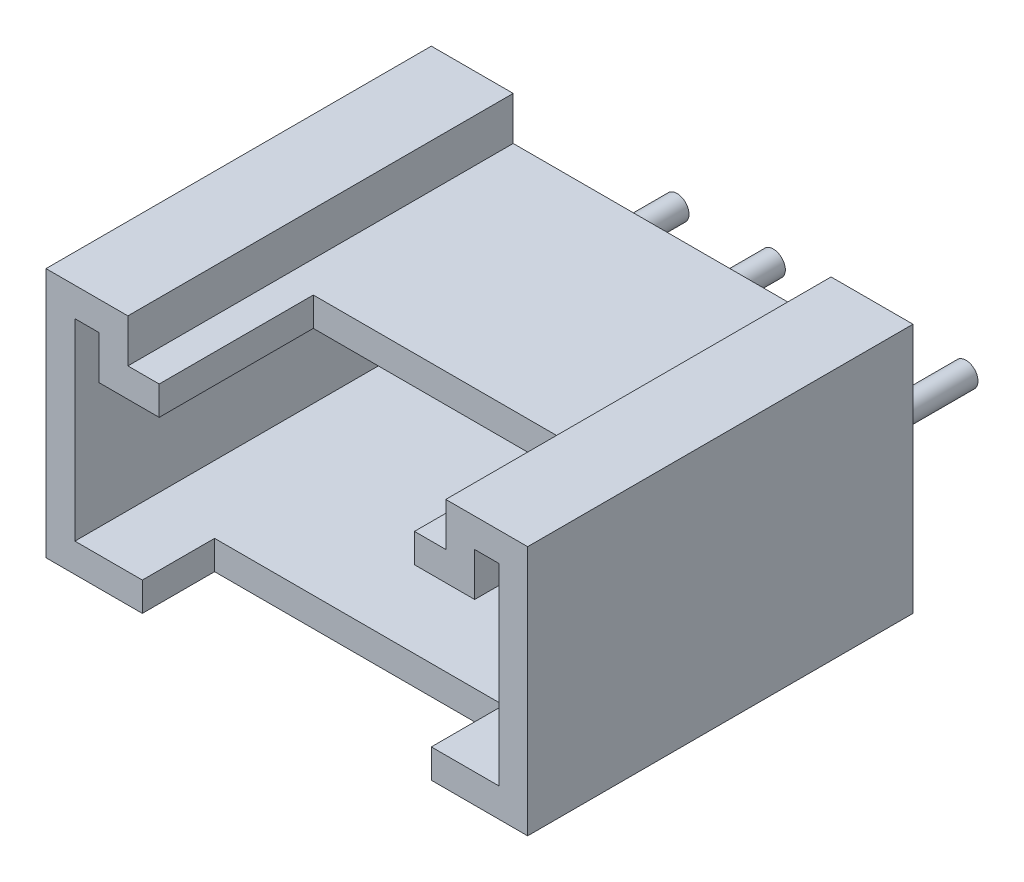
ISO-10303-21;
HEADER;
FILE_DESCRIPTION(('STEP AP214'),'2;1');
FILE_NAME('part.step','',(''),(''),'','','');
FILE_SCHEMA(('AUTOMOTIVE_DESIGN { 1 0 10303 214 1 1 1 1 }'));
ENDSEC;
DATA;
#1=APPLICATION_CONTEXT('core data for automotive mechanical design processes');
#2=APPLICATION_PROTOCOL_DEFINITION('international standard','automotive_design',2000,#1);
#3=PRODUCT_CONTEXT('',#1,'mechanical');
#4=PRODUCT('Part','Part','',(#3));
#5=PRODUCT_RELATED_PRODUCT_CATEGORY('part','',(#4));
#6=PRODUCT_DEFINITION_FORMATION('','',#4);
#7=PRODUCT_DEFINITION_CONTEXT('part definition',#1,'design');
#8=PRODUCT_DEFINITION('design','',#6,#7);
#9=PRODUCT_DEFINITION_SHAPE('','',#8);
#10=(LENGTH_UNIT() NAMED_UNIT(*) SI_UNIT(.MILLI.,.METRE.));
#11=(NAMED_UNIT(*) PLANE_ANGLE_UNIT() SI_UNIT($,.RADIAN.));
#12=(NAMED_UNIT(*) SI_UNIT($,.STERADIAN.) SOLID_ANGLE_UNIT());
#13=UNCERTAINTY_MEASURE_WITH_UNIT(LENGTH_MEASURE(1.E-05),#10,'distance_accuracy_value','');
#14=(GEOMETRIC_REPRESENTATION_CONTEXT(3) GLOBAL_UNCERTAINTY_ASSIGNED_CONTEXT((#13)) GLOBAL_UNIT_ASSIGNED_CONTEXT((#10,
#11,#12)) REPRESENTATION_CONTEXT('',''));
#15=CARTESIAN_POINT('',(0.,0.,0.));
#16=DIRECTION('',(0.,0.,1.));
#17=DIRECTION('',(1.,0.,0.));
#18=AXIS2_PLACEMENT_3D('',#15,#16,#17);
#19=CARTESIAN_POINT('',(0.,0.,8.));
#20=DIRECTION('',(0.,0.,1.));
#21=DIRECTION('',(1.,0.,0.));
#22=AXIS2_PLACEMENT_3D('',#19,#20,#21);
#23=PLANE('',#22);
#24=DIRECTION('',(0.,1.,0.));
#25=VECTOR('',#24,1.);
#26=CARTESIAN_POINT('',(-2.65,3.7,8.));
#27=LINE('',#26,#25);
#28=CARTESIAN_POINT('',(-2.65,3.7,8.));
#29=VERTEX_POINT('',#28);
#30=CARTESIAN_POINT('',(-2.65,4.3,8.));
#31=VERTEX_POINT('',#30);
#32=EDGE_CURVE('E198',#29,#31,#27,.T.);
#33=ORIENTED_EDGE('',*,*,#32,.T.);
#34=DIRECTION('',(-1.,0.,0.));
#35=VECTOR('',#34,1.);
#36=CARTESIAN_POINT('',(-3.3,4.3,8.));
#37=LINE('',#36,#35);
#38=CARTESIAN_POINT('',(-3.3,4.3,8.));
#39=VERTEX_POINT('',#38);
#40=EDGE_CURVE('E250',#31,#39,#37,.T.);
#41=ORIENTED_EDGE('',*,*,#40,.T.);
#42=DIRECTION('',(0.,1.,0.));
#43=VECTOR('',#42,1.);
#44=CARTESIAN_POINT('',(-3.3,4.3,8.));
#45=LINE('',#44,#43);
#46=CARTESIAN_POINT('',(-3.3,5.2,8.));
#47=VERTEX_POINT('',#46);
#48=EDGE_CURVE('E249',#39,#47,#45,.T.);
#49=ORIENTED_EDGE('',*,*,#48,.T.);
#50=DIRECTION('',(-1.,0.,0.));
#51=VECTOR('',#50,1.);
#52=CARTESIAN_POINT('',(-3.3,5.2,8.));
#53=LINE('',#52,#51);
#54=CARTESIAN_POINT('',(-5.,5.2,8.));
#55=VERTEX_POINT('',#54);
#56=EDGE_CURVE('E252',#47,#55,#53,.T.);
#57=ORIENTED_EDGE('',*,*,#56,.T.);
#58=DIRECTION('',(0.,-1.,0.));
#59=VECTOR('',#58,1.);
#60=CARTESIAN_POINT('',(-5.,5.2,8.));
#61=LINE('',#60,#59);
#62=CARTESIAN_POINT('',(-5.,0.,8.));
#63=VERTEX_POINT('',#62);
#64=EDGE_CURVE('E254',#55,#63,#61,.T.);
#65=ORIENTED_EDGE('',*,*,#64,.T.);
#66=DIRECTION('',(1.,0.,0.));
#67=VECTOR('',#66,1.);
#68=CARTESIAN_POINT('',(-5.,0.,8.));
#69=LINE('',#68,#67);
#70=CARTESIAN_POINT('',(-3.,0.,8.));
#71=VERTEX_POINT('',#70);
#72=EDGE_CURVE('E257',#63,#71,#69,.T.);
#73=ORIENTED_EDGE('',*,*,#72,.T.);
#74=DIRECTION('',(0.,-1.,0.));
#75=VECTOR('',#74,1.);
#76=CARTESIAN_POINT('',(-3.,0.6,8.));
#77=LINE('',#76,#75);
#78=CARTESIAN_POINT('',(-3.,0.6,8.));
#79=VERTEX_POINT('',#78);
#80=EDGE_CURVE('E402',#79,#71,#77,.T.);
#81=ORIENTED_EDGE('',*,*,#80,.F.);
#82=DIRECTION('',(1.,0.,0.));
#83=VECTOR('',#82,1.);
#84=CARTESIAN_POINT('',(-5.,0.6,8.));
#85=LINE('',#84,#83);
#86=CARTESIAN_POINT('',(-4.4,0.6,8.));
#87=VERTEX_POINT('',#86);
#88=EDGE_CURVE('E235',#87,#79,#85,.T.);
#89=ORIENTED_EDGE('',*,*,#88,.F.);
#90=DIRECTION('',(0.,-1.,0.));
#91=VECTOR('',#90,1.);
#92=CARTESIAN_POINT('',(-4.4,5.2,8.));
#93=LINE('',#92,#91);
#94=CARTESIAN_POINT('',(-4.4,4.6,8.));
#95=VERTEX_POINT('',#94);
#96=EDGE_CURVE('E232',#95,#87,#93,.T.);
#97=ORIENTED_EDGE('',*,*,#96,.F.);
#98=DIRECTION('',(-1.,0.,0.));
#99=VECTOR('',#98,1.);
#100=CARTESIAN_POINT('',(-3.3,4.6,8.));
#101=LINE('',#100,#99);
#102=CARTESIAN_POINT('',(-3.9,4.6,8.));
#103=VERTEX_POINT('',#102);
#104=EDGE_CURVE('E230',#103,#95,#101,.T.);
#105=ORIENTED_EDGE('',*,*,#104,.F.);
#106=DIRECTION('',(0.,1.,0.));
#107=VECTOR('',#106,1.);
#108=CARTESIAN_POINT('',(-3.9,4.3,8.));
#109=LINE('',#108,#107);
#110=CARTESIAN_POINT('',(-3.9,3.7,8.));
#111=VERTEX_POINT('',#110);
#112=EDGE_CURVE('E220',#111,#103,#109,.T.);
#113=ORIENTED_EDGE('',*,*,#112,.F.);
#114=DIRECTION('',(-1.,0.,0.));
#115=VECTOR('',#114,1.);
#116=CARTESIAN_POINT('',(-3.3,3.7,8.));
#117=LINE('',#116,#115);
#118=EDGE_CURVE('E212',#29,#111,#117,.T.);
#119=ORIENTED_EDGE('',*,*,#118,.F.);
#120=EDGE_LOOP('',(#33,#41,#49,#57,#65,#73,#81,#89,#97,#105,#113,#119));
#121=FACE_BOUND('',#120,.T.);
#122=ADVANCED_FACE('F37',(#121),#23,.T.);
#123=CARTESIAN_POINT('',(-3.3,4.3,8.));
#124=DIRECTION('',(0.,-1.,0.));
#125=DIRECTION('',(0.,0.,-1.));
#126=AXIS2_PLACEMENT_3D('',#123,#124,#125);
#127=PLANE('',#126);
#128=ORIENTED_EDGE('',*,*,#40,.F.);
#129=DIRECTION('',(0.,0.,1.));
#130=VECTOR('',#129,1.);
#131=CARTESIAN_POINT('',(-2.65,4.3,8.));
#132=LINE('',#131,#130);
#133=CARTESIAN_POINT('',(-2.65,4.3,4.8));
#134=VERTEX_POINT('',#133);
#135=EDGE_CURVE('E203',#134,#31,#132,.T.);
#136=ORIENTED_EDGE('',*,*,#135,.F.);
#137=DIRECTION('',(-1.,0.,0.));
#138=VECTOR('',#137,1.);
#139=CARTESIAN_POINT('',(-2.65,4.3,4.8));
#140=LINE('',#139,#138);
#141=CARTESIAN_POINT('',(2.65,4.3,4.8));
#142=VERTEX_POINT('',#141);
#143=EDGE_CURVE('E216',#142,#134,#140,.T.);
#144=ORIENTED_EDGE('',*,*,#143,.F.);
#145=DIRECTION('',(0.,0.,-1.));
#146=VECTOR('',#145,1.);
#147=CARTESIAN_POINT('',(2.65,4.3,8.));
#148=LINE('',#147,#146);
#149=CARTESIAN_POINT('',(2.65,4.3,8.));
#150=VERTEX_POINT('',#149);
#151=EDGE_CURVE('E373',#150,#142,#148,.T.);
#152=ORIENTED_EDGE('',*,*,#151,.F.);
#153=CARTESIAN_POINT('',(3.3,4.3,8.));
#154=VERTEX_POINT('',#153);
#155=EDGE_CURVE('E246',#154,#150,#37,.T.);
#156=ORIENTED_EDGE('',*,*,#155,.F.);
#157=DIRECTION('',(0.,0.,-1.));
#158=VECTOR('',#157,1.);
#159=CARTESIAN_POINT('',(3.3,4.3,8.));
#160=LINE('',#159,#158);
#161=CARTESIAN_POINT('',(3.3,4.3,0.));
#162=VERTEX_POINT('',#161);
#163=EDGE_CURVE('E266',#154,#162,#160,.T.);
#164=ORIENTED_EDGE('',*,*,#163,.T.);
#165=DIRECTION('',(-1.,0.,0.));
#166=VECTOR('',#165,1.);
#167=CARTESIAN_POINT('',(-3.3,4.3,0.));
#168=LINE('',#167,#166);
#169=CARTESIAN_POINT('',(-3.3,4.3,0.));
#170=VERTEX_POINT('',#169);
#171=EDGE_CURVE('E267',#162,#170,#168,.T.);
#172=ORIENTED_EDGE('',*,*,#171,.T.);
#173=DIRECTION('',(0.,0.,-1.));
#174=VECTOR('',#173,1.);
#175=CARTESIAN_POINT('',(-3.3,4.3,8.));
#176=LINE('',#175,#174);
#177=EDGE_CURVE('E305',#39,#170,#176,.T.);
#178=ORIENTED_EDGE('',*,*,#177,.F.);
#179=EDGE_LOOP('',(#128,#136,#144,#152,#156,#164,#172,#178));
#180=FACE_BOUND('',#179,.T.);
#181=ADVANCED_FACE('F39',(#180),#127,.F.);
#182=CARTESIAN_POINT('',(-3.3,4.3,8.));
#183=DIRECTION('',(-1.,0.,0.));
#184=DIRECTION('',(0.,0.,1.));
#185=AXIS2_PLACEMENT_3D('',#182,#183,#184);
#186=PLANE('',#185);
#187=DIRECTION('',(0.,1.,0.));
#188=VECTOR('',#187,1.);
#189=CARTESIAN_POINT('',(-3.3,4.3,0.));
#190=LINE('',#189,#188);
#191=CARTESIAN_POINT('',(-3.3,5.2,0.));
#192=VERTEX_POINT('',#191);
#193=EDGE_CURVE('E270',#170,#192,#190,.T.);
#194=ORIENTED_EDGE('',*,*,#193,.T.);
#195=DIRECTION('',(0.,0.,-1.));
#196=VECTOR('',#195,1.);
#197=CARTESIAN_POINT('',(-3.3,5.2,8.));
#198=LINE('',#197,#196);
#199=EDGE_CURVE('E302',#47,#192,#198,.T.);
#200=ORIENTED_EDGE('',*,*,#199,.F.);
#201=ORIENTED_EDGE('',*,*,#48,.F.);
#202=ORIENTED_EDGE('',*,*,#177,.T.);
#203=EDGE_LOOP('',(#194,#200,#201,#202));
#204=FACE_BOUND('',#203,.T.);
#205=ADVANCED_FACE('F370',(#204),#186,.F.);
#206=CARTESIAN_POINT('',(-3.3,5.2,8.));
#207=DIRECTION('',(0.,-1.,0.));
#208=DIRECTION('',(0.,0.,-1.));
#209=AXIS2_PLACEMENT_3D('',#206,#207,#208);
#210=PLANE('',#209);
#211=DIRECTION('',(-1.,0.,0.));
#212=VECTOR('',#211,1.);
#213=CARTESIAN_POINT('',(-3.3,5.2,0.));
#214=LINE('',#213,#212);
#215=CARTESIAN_POINT('',(-5.,5.2,0.));
#216=VERTEX_POINT('',#215);
#217=EDGE_CURVE('E273',#192,#216,#214,.T.);
#218=ORIENTED_EDGE('',*,*,#217,.T.);
#219=DIRECTION('',(0.,0.,-1.));
#220=VECTOR('',#219,1.);
#221=CARTESIAN_POINT('',(-5.,5.2,8.));
#222=LINE('',#221,#220);
#223=EDGE_CURVE('E299',#55,#216,#222,.T.);
#224=ORIENTED_EDGE('',*,*,#223,.F.);
#225=ORIENTED_EDGE('',*,*,#56,.F.);
#226=ORIENTED_EDGE('',*,*,#199,.T.);
#227=EDGE_LOOP('',(#218,#224,#225,#226));
#228=FACE_BOUND('',#227,.T.);
#229=ADVANCED_FACE('F365',(#228),#210,.F.);
#230=CARTESIAN_POINT('',(-5.,5.2,8.));
#231=DIRECTION('',(1.,0.,0.));
#232=DIRECTION('',(0.,0.,-1.));
#233=AXIS2_PLACEMENT_3D('',#230,#231,#232);
#234=PLANE('',#233);
#235=DIRECTION('',(0.,-1.,0.));
#236=VECTOR('',#235,1.);
#237=CARTESIAN_POINT('',(-5.,5.2,0.));
#238=LINE('',#237,#236);
#239=CARTESIAN_POINT('',(-5.,0.,0.));
#240=VERTEX_POINT('',#239);
#241=EDGE_CURVE('E275',#216,#240,#238,.T.);
#242=ORIENTED_EDGE('',*,*,#241,.T.);
#243=DIRECTION('',(0.,0.,-1.));
#244=VECTOR('',#243,1.);
#245=CARTESIAN_POINT('',(-5.,0.,8.));
#246=LINE('',#245,#244);
#247=EDGE_CURVE('E296',#63,#240,#246,.T.);
#248=ORIENTED_EDGE('',*,*,#247,.F.);
#249=ORIENTED_EDGE('',*,*,#64,.F.);
#250=ORIENTED_EDGE('',*,*,#223,.T.);
#251=EDGE_LOOP('',(#242,#248,#249,#250));
#252=FACE_BOUND('',#251,.T.);
#253=ADVANCED_FACE('F362',(#252),#234,.F.);
#254=CARTESIAN_POINT('',(-5.,0.,8.));
#255=DIRECTION('',(0.,1.,0.));
#256=DIRECTION('',(-1.,0.,0.));
#257=AXIS2_PLACEMENT_3D('',#254,#255,#256);
#258=PLANE('',#257);
#259=DIRECTION('',(1.,0.,0.));
#260=VECTOR('',#259,1.);
#261=CARTESIAN_POINT('',(-3.,0.,6.5));
#262=LINE('',#261,#260);
#263=CARTESIAN_POINT('',(-3.,0.,6.5));
#264=VERTEX_POINT('',#263);
#265=CARTESIAN_POINT('',(3.,0.,6.5));
#266=VERTEX_POINT('',#265);
#267=EDGE_CURVE('E398',#264,#266,#262,.T.);
#268=ORIENTED_EDGE('',*,*,#267,.F.);
#269=DIRECTION('',(0.,0.,-1.));
#270=VECTOR('',#269,1.);
#271=CARTESIAN_POINT('',(-3.,0.,8.));
#272=LINE('',#271,#270);
#273=EDGE_CURVE('E383',#71,#264,#272,.T.);
#274=ORIENTED_EDGE('',*,*,#273,.F.);
#275=ORIENTED_EDGE('',*,*,#72,.F.);
#276=ORIENTED_EDGE('',*,*,#247,.T.);
#277=DIRECTION('',(1.,0.,0.));
#278=VECTOR('',#277,1.);
#279=CARTESIAN_POINT('',(-5.,0.,0.));
#280=LINE('',#279,#278);
#281=CARTESIAN_POINT('',(5.,0.,0.));
#282=VERTEX_POINT('',#281);
#283=EDGE_CURVE('E277',#240,#282,#280,.T.);
#284=ORIENTED_EDGE('',*,*,#283,.T.);
#285=DIRECTION('',(0.,0.,-1.));
#286=VECTOR('',#285,1.);
#287=CARTESIAN_POINT('',(5.,0.,8.));
#288=LINE('',#287,#286);
#289=CARTESIAN_POINT('',(5.,0.,8.));
#290=VERTEX_POINT('',#289);
#291=EDGE_CURVE('E293',#290,#282,#288,.T.);
#292=ORIENTED_EDGE('',*,*,#291,.F.);
#293=CARTESIAN_POINT('',(3.,0.,8.));
#294=VERTEX_POINT('',#293);
#295=EDGE_CURVE('E256',#294,#290,#69,.T.);
#296=ORIENTED_EDGE('',*,*,#295,.F.);
#297=DIRECTION('',(0.,0.,1.));
#298=VECTOR('',#297,1.);
#299=CARTESIAN_POINT('',(3.,0.,8.));
#300=LINE('',#299,#298);
#301=EDGE_CURVE('E391',#266,#294,#300,.T.);
#302=ORIENTED_EDGE('',*,*,#301,.F.);
#303=EDGE_LOOP('',(#268,#274,#275,#276,#284,#292,#296,#302));
#304=FACE_BOUND('',#303,.T.);
#305=ADVANCED_FACE('F355',(#304),#258,.F.);
#306=CARTESIAN_POINT('',(5.,5.2,8.));
#307=DIRECTION('',(-1.,0.,0.));
#308=DIRECTION('',(0.,0.,1.));
#309=AXIS2_PLACEMENT_3D('',#306,#307,#308);
#310=PLANE('',#309);
#311=DIRECTION('',(0.,1.,0.));
#312=VECTOR('',#311,1.);
#313=CARTESIAN_POINT('',(5.,5.2,0.));
#314=LINE('',#313,#312);
#315=CARTESIAN_POINT('',(5.,5.2,0.));
#316=VERTEX_POINT('',#315);
#317=EDGE_CURVE('E279',#282,#316,#314,.T.);
#318=ORIENTED_EDGE('',*,*,#317,.T.);
#319=DIRECTION('',(0.,0.,-1.));
#320=VECTOR('',#319,1.);
#321=CARTESIAN_POINT('',(5.,5.2,8.));
#322=LINE('',#321,#320);
#323=CARTESIAN_POINT('',(5.,5.2,8.));
#324=VERTEX_POINT('',#323);
#325=EDGE_CURVE('E290',#324,#316,#322,.T.);
#326=ORIENTED_EDGE('',*,*,#325,.F.);
#327=DIRECTION('',(0.,1.,0.));
#328=VECTOR('',#327,1.);
#329=CARTESIAN_POINT('',(5.,5.2,8.));
#330=LINE('',#329,#328);
#331=EDGE_CURVE('E260',#290,#324,#330,.T.);
#332=ORIENTED_EDGE('',*,*,#331,.F.);
#333=ORIENTED_EDGE('',*,*,#291,.T.);
#334=EDGE_LOOP('',(#318,#326,#332,#333));
#335=FACE_BOUND('',#334,.T.);
#336=ADVANCED_FACE('F349',(#335),#310,.F.);
#337=CARTESIAN_POINT('',(3.3,5.2,8.));
#338=DIRECTION('',(0.,-1.,0.));
#339=DIRECTION('',(0.,0.,-1.));
#340=AXIS2_PLACEMENT_3D('',#337,#338,#339);
#341=PLANE('',#340);
#342=DIRECTION('',(-1.,0.,0.));
#343=VECTOR('',#342,1.);
#344=CARTESIAN_POINT('',(3.3,5.2,0.));
#345=LINE('',#344,#343);
#346=CARTESIAN_POINT('',(3.3,5.2,0.));
#347=VERTEX_POINT('',#346);
#348=EDGE_CURVE('E281',#316,#347,#345,.T.);
#349=ORIENTED_EDGE('',*,*,#348,.T.);
#350=DIRECTION('',(0.,0.,-1.));
#351=VECTOR('',#350,1.);
#352=CARTESIAN_POINT('',(3.3,5.2,8.));
#353=LINE('',#352,#351);
#354=CARTESIAN_POINT('',(3.3,5.2,8.));
#355=VERTEX_POINT('',#354);
#356=EDGE_CURVE('E287',#355,#347,#353,.T.);
#357=ORIENTED_EDGE('',*,*,#356,.F.);
#358=DIRECTION('',(-1.,0.,0.));
#359=VECTOR('',#358,1.);
#360=CARTESIAN_POINT('',(3.3,5.2,8.));
#361=LINE('',#360,#359);
#362=EDGE_CURVE('E262',#324,#355,#361,.T.);
#363=ORIENTED_EDGE('',*,*,#362,.F.);
#364=ORIENTED_EDGE('',*,*,#325,.T.);
#365=EDGE_LOOP('',(#349,#357,#363,#364));
#366=FACE_BOUND('',#365,.T.);
#367=ADVANCED_FACE('F343',(#366),#341,.F.);
#368=CARTESIAN_POINT('',(3.3,4.3,8.));
#369=DIRECTION('',(1.,0.,0.));
#370=DIRECTION('',(0.,0.,-1.));
#371=AXIS2_PLACEMENT_3D('',#368,#369,#370);
#372=PLANE('',#371);
#373=DIRECTION('',(0.,-1.,0.));
#374=VECTOR('',#373,1.);
#375=CARTESIAN_POINT('',(3.3,4.3,0.));
#376=LINE('',#375,#374);
#377=EDGE_CURVE('E283',#347,#162,#376,.T.);
#378=ORIENTED_EDGE('',*,*,#377,.T.);
#379=ORIENTED_EDGE('',*,*,#163,.F.);
#380=DIRECTION('',(0.,-1.,0.));
#381=VECTOR('',#380,1.);
#382=CARTESIAN_POINT('',(3.3,4.3,8.));
#383=LINE('',#382,#381);
#384=EDGE_CURVE('E264',#355,#154,#383,.T.);
#385=ORIENTED_EDGE('',*,*,#384,.F.);
#386=ORIENTED_EDGE('',*,*,#356,.T.);
#387=EDGE_LOOP('',(#378,#379,#385,#386));
#388=FACE_BOUND('',#387,.T.);
#389=ADVANCED_FACE('F339',(#388),#372,.F.);
#390=DIRECTION('',(0.,1.,0.));
#391=VECTOR('',#390,1.);
#392=CARTESIAN_POINT('',(2.65,3.7,8.));
#393=LINE('',#392,#391);
#394=CARTESIAN_POINT('',(2.65,3.7,8.));
#395=VERTEX_POINT('',#394);
#396=EDGE_CURVE('E207',#395,#150,#393,.T.);
#397=ORIENTED_EDGE('',*,*,#396,.F.);
#398=CARTESIAN_POINT('',(3.9,3.7,8.));
#399=VERTEX_POINT('',#398);
#400=EDGE_CURVE('E221',#399,#395,#117,.T.);
#401=ORIENTED_EDGE('',*,*,#400,.F.);
#402=DIRECTION('',(0.,-1.,0.));
#403=VECTOR('',#402,1.);
#404=CARTESIAN_POINT('',(3.9,4.3,8.));
#405=LINE('',#404,#403);
#406=CARTESIAN_POINT('',(3.9,4.6,8.));
#407=VERTEX_POINT('',#406);
#408=EDGE_CURVE('E243',#407,#399,#405,.T.);
#409=ORIENTED_EDGE('',*,*,#408,.F.);
#410=DIRECTION('',(-1.,0.,0.));
#411=VECTOR('',#410,1.);
#412=CARTESIAN_POINT('',(3.3,4.6,8.));
#413=LINE('',#412,#411);
#414=CARTESIAN_POINT('',(4.4,4.6,8.));
#415=VERTEX_POINT('',#414);
#416=EDGE_CURVE('E240',#415,#407,#413,.T.);
#417=ORIENTED_EDGE('',*,*,#416,.F.);
#418=DIRECTION('',(0.,1.,0.));
#419=VECTOR('',#418,1.);
#420=CARTESIAN_POINT('',(4.4,5.2,8.));
#421=LINE('',#420,#419);
#422=CARTESIAN_POINT('',(4.4,0.6,8.));
#423=VERTEX_POINT('',#422);
#424=EDGE_CURVE('E238',#423,#415,#421,.T.);
#425=ORIENTED_EDGE('',*,*,#424,.F.);
#426=CARTESIAN_POINT('',(3.,0.6,8.));
#427=VERTEX_POINT('',#426);
#428=EDGE_CURVE('E234',#427,#423,#85,.T.);
#429=ORIENTED_EDGE('',*,*,#428,.F.);
#430=DIRECTION('',(0.,-1.,0.));
#431=VECTOR('',#430,1.);
#432=CARTESIAN_POINT('',(3.,0.6,8.));
#433=LINE('',#432,#431);
#434=EDGE_CURVE('E405',#427,#294,#433,.T.);
#435=ORIENTED_EDGE('',*,*,#434,.T.);
#436=ORIENTED_EDGE('',*,*,#295,.T.);
#437=ORIENTED_EDGE('',*,*,#331,.T.);
#438=ORIENTED_EDGE('',*,*,#362,.T.);
#439=ORIENTED_EDGE('',*,*,#384,.T.);
#440=ORIENTED_EDGE('',*,*,#155,.T.);
#441=EDGE_LOOP('',(#397,#401,#409,#417,#425,#429,#435,#436,#437,#438,#439,#440));
#442=FACE_BOUND('',#441,.T.);
#443=ADVANCED_FACE('F321',(#442),#23,.T.);
#444=CARTESIAN_POINT('',(0.,0.,0.));
#445=DIRECTION('',(0.,0.,1.));
#446=DIRECTION('',(1.,0.,0.));
#447=AXIS2_PLACEMENT_3D('',#444,#445,#446);
#448=PLANE('',#447);
#449=CARTESIAN_POINT('',(1.,1.75220598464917,0.));
#450=DIRECTION('',(0.,0.,1.));
#451=DIRECTION('',(1.,0.,0.));
#452=AXIS2_PLACEMENT_3D('',#449,#450,#451);
#453=CIRCLE('',#452,0.25);
#454=CARTESIAN_POINT('',(1.25,1.75220598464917,0.));
#455=VERTEX_POINT('',#454);
#456=EDGE_CURVE('E11',#455,#455,#453,.F.);
#457=ORIENTED_EDGE('',*,*,#456,.F.);
#458=EDGE_LOOP('',(#457));
#459=FACE_BOUND('',#458,.T.);
#460=CARTESIAN_POINT('',(3.,1.75220598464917,0.));
#461=DIRECTION('',(0.,0.,1.));
#462=DIRECTION('',(1.,0.,0.));
#463=AXIS2_PLACEMENT_3D('',#460,#461,#462);
#464=CIRCLE('',#463,0.25);
#465=CARTESIAN_POINT('',(3.25,1.75220598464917,0.));
#466=VERTEX_POINT('',#465);
#467=EDGE_CURVE('E45',#466,#466,#464,.F.);
#468=ORIENTED_EDGE('',*,*,#467,.F.);
#469=EDGE_LOOP('',(#468));
#470=FACE_BOUND('',#469,.T.);
#471=CARTESIAN_POINT('',(-3.,1.75220598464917,0.));
#472=DIRECTION('',(0.,0.,1.));
#473=DIRECTION('',(1.,0.,0.));
#474=AXIS2_PLACEMENT_3D('',#471,#472,#473);
#475=CIRCLE('',#474,0.25);
#476=CARTESIAN_POINT('',(-2.75,1.75220598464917,0.));
#477=VERTEX_POINT('',#476);
#478=EDGE_CURVE('E311',#477,#477,#475,.F.);
#479=ORIENTED_EDGE('',*,*,#478,.F.);
#480=EDGE_LOOP('',(#479));
#481=FACE_BOUND('',#480,.T.);
#482=CARTESIAN_POINT('',(-1.,1.75220598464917,0.));
#483=DIRECTION('',(0.,0.,1.));
#484=DIRECTION('',(1.,0.,0.));
#485=AXIS2_PLACEMENT_3D('',#482,#483,#484);
#486=CIRCLE('',#485,0.25);
#487=CARTESIAN_POINT('',(-0.75,1.75220598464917,0.));
#488=VERTEX_POINT('',#487);
#489=EDGE_CURVE('E308',#488,#488,#486,.F.);
#490=ORIENTED_EDGE('',*,*,#489,.F.);
#491=EDGE_LOOP('',(#490));
#492=FACE_BOUND('',#491,.T.);
#493=ORIENTED_EDGE('',*,*,#171,.F.);
#494=ORIENTED_EDGE('',*,*,#377,.F.);
#495=ORIENTED_EDGE('',*,*,#348,.F.);
#496=ORIENTED_EDGE('',*,*,#317,.F.);
#497=ORIENTED_EDGE('',*,*,#283,.F.);
#498=ORIENTED_EDGE('',*,*,#241,.F.);
#499=ORIENTED_EDGE('',*,*,#217,.F.);
#500=ORIENTED_EDGE('',*,*,#193,.F.);
#501=EDGE_LOOP('',(#493,#494,#495,#496,#497,#498,#499,#500));
#502=FACE_BOUND('',#501,.T.);
#503=ADVANCED_FACE('F318',(#459,#470,#481,#492,#502),#448,.F.);
#504=CARTESIAN_POINT('',(-3.3,3.7,8.));
#505=DIRECTION('',(0.,-1.,0.));
#506=DIRECTION('',(0.,0.,-1.));
#507=AXIS2_PLACEMENT_3D('',#504,#505,#506);
#508=PLANE('',#507);
#509=DIRECTION('',(0.,0.,1.));
#510=VECTOR('',#509,1.);
#511=CARTESIAN_POINT('',(-2.65,3.7,8.));
#512=LINE('',#511,#510);
#513=CARTESIAN_POINT('',(-2.65,3.7,4.8));
#514=VERTEX_POINT('',#513);
#515=EDGE_CURVE('E201',#514,#29,#512,.T.);
#516=ORIENTED_EDGE('',*,*,#515,.T.);
#517=ORIENTED_EDGE('',*,*,#118,.T.);
#518=DIRECTION('',(0.,0.,-1.));
#519=VECTOR('',#518,1.);
#520=CARTESIAN_POINT('',(-3.9,3.7,8.));
#521=LINE('',#520,#519);
#522=CARTESIAN_POINT('',(-3.9,3.7,0.6));
#523=VERTEX_POINT('',#522);
#524=EDGE_CURVE('E271',#111,#523,#521,.T.);
#525=ORIENTED_EDGE('',*,*,#524,.T.);
#526=DIRECTION('',(-1.,0.,0.));
#527=VECTOR('',#526,1.);
#528=CARTESIAN_POINT('',(-3.3,3.7,0.6));
#529=LINE('',#528,#527);
#530=CARTESIAN_POINT('',(3.9,3.7,0.6));
#531=VERTEX_POINT('',#530);
#532=EDGE_CURVE('E422',#531,#523,#529,.T.);
#533=ORIENTED_EDGE('',*,*,#532,.F.);
#534=DIRECTION('',(0.,0.,-1.));
#535=VECTOR('',#534,1.);
#536=CARTESIAN_POINT('',(3.9,3.7,8.));
#537=LINE('',#536,#535);
#538=EDGE_CURVE('E245',#399,#531,#537,.T.);
#539=ORIENTED_EDGE('',*,*,#538,.F.);
#540=ORIENTED_EDGE('',*,*,#400,.T.);
#541=DIRECTION('',(0.,0.,-1.));
#542=VECTOR('',#541,1.);
#543=CARTESIAN_POINT('',(2.65,3.7,8.));
#544=LINE('',#543,#542);
#545=CARTESIAN_POINT('',(2.65,3.7,4.8));
#546=VERTEX_POINT('',#545);
#547=EDGE_CURVE('E215',#395,#546,#544,.T.);
#548=ORIENTED_EDGE('',*,*,#547,.T.);
#549=DIRECTION('',(-1.,0.,0.));
#550=VECTOR('',#549,1.);
#551=CARTESIAN_POINT('',(-2.65,3.7,4.8));
#552=LINE('',#551,#550);
#553=EDGE_CURVE('E52',#546,#514,#552,.T.);
#554=ORIENTED_EDGE('',*,*,#553,.T.);
#555=EDGE_LOOP('',(#516,#517,#525,#533,#539,#540,#548,#554));
#556=FACE_BOUND('',#555,.T.);
#557=ADVANCED_FACE('F210',(#556),#508,.T.);
#558=CARTESIAN_POINT('',(-3.9,4.3,8.));
#559=DIRECTION('',(-1.,0.,0.));
#560=DIRECTION('',(0.,0.,1.));
#561=AXIS2_PLACEMENT_3D('',#558,#559,#560);
#562=PLANE('',#561);
#563=DIRECTION('',(0.,1.,0.));
#564=VECTOR('',#563,1.);
#565=CARTESIAN_POINT('',(-3.9,4.3,0.6));
#566=LINE('',#565,#564);
#567=CARTESIAN_POINT('',(-3.9,4.6,0.6));
#568=VERTEX_POINT('',#567);
#569=EDGE_CURVE('E425',#523,#568,#566,.T.);
#570=ORIENTED_EDGE('',*,*,#569,.F.);
#571=ORIENTED_EDGE('',*,*,#524,.F.);
#572=ORIENTED_EDGE('',*,*,#112,.T.);
#573=DIRECTION('',(0.,0.,-1.));
#574=VECTOR('',#573,1.);
#575=CARTESIAN_POINT('',(-3.9,4.6,8.));
#576=LINE('',#575,#574);
#577=EDGE_CURVE('E427',#103,#568,#576,.T.);
#578=ORIENTED_EDGE('',*,*,#577,.T.);
#579=EDGE_LOOP('',(#570,#571,#572,#578));
#580=FACE_BOUND('',#579,.T.);
#581=ADVANCED_FACE('F479',(#580),#562,.T.);
#582=CARTESIAN_POINT('',(-3.3,4.6,8.));
#583=DIRECTION('',(0.,-1.,0.));
#584=DIRECTION('',(0.,0.,-1.));
#585=AXIS2_PLACEMENT_3D('',#582,#583,#584);
#586=PLANE('',#585);
#587=DIRECTION('',(-1.,0.,0.));
#588=VECTOR('',#587,1.);
#589=CARTESIAN_POINT('',(-3.3,4.6,0.6));
#590=LINE('',#589,#588);
#591=CARTESIAN_POINT('',(-4.4,4.6,0.6));
#592=VERTEX_POINT('',#591);
#593=EDGE_CURVE('E432',#568,#592,#590,.T.);
#594=ORIENTED_EDGE('',*,*,#593,.F.);
#595=ORIENTED_EDGE('',*,*,#577,.F.);
#596=ORIENTED_EDGE('',*,*,#104,.T.);
#597=DIRECTION('',(0.,0.,-1.));
#598=VECTOR('',#597,1.);
#599=CARTESIAN_POINT('',(-4.4,4.6,8.));
#600=LINE('',#599,#598);
#601=EDGE_CURVE('E435',#95,#592,#600,.T.);
#602=ORIENTED_EDGE('',*,*,#601,.T.);
#603=EDGE_LOOP('',(#594,#595,#596,#602));
#604=FACE_BOUND('',#603,.T.);
#605=ADVANCED_FACE('F485',(#604),#586,.T.);
#606=CARTESIAN_POINT('',(-4.4,5.2,8.));
#607=DIRECTION('',(1.,0.,0.));
#608=DIRECTION('',(0.,0.,-1.));
#609=AXIS2_PLACEMENT_3D('',#606,#607,#608);
#610=PLANE('',#609);
#611=DIRECTION('',(0.,-1.,0.));
#612=VECTOR('',#611,1.);
#613=CARTESIAN_POINT('',(-4.4,5.2,0.6));
#614=LINE('',#613,#612);
#615=CARTESIAN_POINT('',(-4.4,0.6,0.6));
#616=VERTEX_POINT('',#615);
#617=EDGE_CURVE('E437',#592,#616,#614,.T.);
#618=ORIENTED_EDGE('',*,*,#617,.F.);
#619=ORIENTED_EDGE('',*,*,#601,.F.);
#620=ORIENTED_EDGE('',*,*,#96,.T.);
#621=DIRECTION('',(0.,0.,-1.));
#622=VECTOR('',#621,1.);
#623=CARTESIAN_POINT('',(-4.4,0.6,8.));
#624=LINE('',#623,#622);
#625=EDGE_CURVE('E440',#87,#616,#624,.T.);
#626=ORIENTED_EDGE('',*,*,#625,.T.);
#627=EDGE_LOOP('',(#618,#619,#620,#626));
#628=FACE_BOUND('',#627,.T.);
#629=ADVANCED_FACE('F488',(#628),#610,.T.);
#630=CARTESIAN_POINT('',(-5.,0.6,8.));
#631=DIRECTION('',(0.,1.,0.));
#632=DIRECTION('',(-1.,0.,0.));
#633=AXIS2_PLACEMENT_3D('',#630,#631,#632);
#634=PLANE('',#633);
#635=DIRECTION('',(0.,0.,-1.));
#636=VECTOR('',#635,1.);
#637=CARTESIAN_POINT('',(-3.,0.6,8.));
#638=LINE('',#637,#636);
#639=CARTESIAN_POINT('',(-3.,0.6,6.5));
#640=VERTEX_POINT('',#639);
#641=EDGE_CURVE('E387',#79,#640,#638,.T.);
#642=ORIENTED_EDGE('',*,*,#641,.T.);
#643=DIRECTION('',(1.,0.,0.));
#644=VECTOR('',#643,1.);
#645=CARTESIAN_POINT('',(-3.,0.6,6.5));
#646=LINE('',#645,#644);
#647=CARTESIAN_POINT('',(3.,0.6,6.5));
#648=VERTEX_POINT('',#647);
#649=EDGE_CURVE('E390',#640,#648,#646,.T.);
#650=ORIENTED_EDGE('',*,*,#649,.T.);
#651=DIRECTION('',(0.,0.,1.));
#652=VECTOR('',#651,1.);
#653=CARTESIAN_POINT('',(3.,0.6,8.));
#654=LINE('',#653,#652);
#655=EDGE_CURVE('E60',#648,#427,#654,.T.);
#656=ORIENTED_EDGE('',*,*,#655,.T.);
#657=ORIENTED_EDGE('',*,*,#428,.T.);
#658=DIRECTION('',(0.,0.,-1.));
#659=VECTOR('',#658,1.);
#660=CARTESIAN_POINT('',(4.4,0.6,8.));
#661=LINE('',#660,#659);
#662=CARTESIAN_POINT('',(4.4,0.6,0.6));
#663=VERTEX_POINT('',#662);
#664=EDGE_CURVE('E445',#423,#663,#661,.T.);
#665=ORIENTED_EDGE('',*,*,#664,.T.);
#666=DIRECTION('',(1.,0.,0.));
#667=VECTOR('',#666,1.);
#668=CARTESIAN_POINT('',(-5.,0.6,0.6));
#669=LINE('',#668,#667);
#670=EDGE_CURVE('E442',#616,#663,#669,.T.);
#671=ORIENTED_EDGE('',*,*,#670,.F.);
#672=ORIENTED_EDGE('',*,*,#625,.F.);
#673=ORIENTED_EDGE('',*,*,#88,.T.);
#674=EDGE_LOOP('',(#642,#650,#656,#657,#665,#671,#672,#673));
#675=FACE_BOUND('',#674,.T.);
#676=ADVANCED_FACE('F492',(#675),#634,.T.);
#677=CARTESIAN_POINT('',(4.4,5.2,8.));
#678=DIRECTION('',(-1.,0.,0.));
#679=DIRECTION('',(0.,0.,1.));
#680=AXIS2_PLACEMENT_3D('',#677,#678,#679);
#681=PLANE('',#680);
#682=DIRECTION('',(0.,1.,0.));
#683=VECTOR('',#682,1.);
#684=CARTESIAN_POINT('',(4.4,5.2,0.6));
#685=LINE('',#684,#683);
#686=CARTESIAN_POINT('',(4.4,4.6,0.6));
#687=VERTEX_POINT('',#686);
#688=EDGE_CURVE('E447',#663,#687,#685,.T.);
#689=ORIENTED_EDGE('',*,*,#688,.F.);
#690=ORIENTED_EDGE('',*,*,#664,.F.);
#691=ORIENTED_EDGE('',*,*,#424,.T.);
#692=DIRECTION('',(0.,0.,-1.));
#693=VECTOR('',#692,1.);
#694=CARTESIAN_POINT('',(4.4,4.6,8.));
#695=LINE('',#694,#693);
#696=EDGE_CURVE('E450',#415,#687,#695,.T.);
#697=ORIENTED_EDGE('',*,*,#696,.T.);
#698=EDGE_LOOP('',(#689,#690,#691,#697));
#699=FACE_BOUND('',#698,.T.);
#700=ADVANCED_FACE('F472',(#699),#681,.T.);
#701=CARTESIAN_POINT('',(3.3,4.6,8.));
#702=DIRECTION('',(0.,-1.,0.));
#703=DIRECTION('',(0.,0.,-1.));
#704=AXIS2_PLACEMENT_3D('',#701,#702,#703);
#705=PLANE('',#704);
#706=DIRECTION('',(-1.,0.,0.));
#707=VECTOR('',#706,1.);
#708=CARTESIAN_POINT('',(3.3,4.6,0.6));
#709=LINE('',#708,#707);
#710=CARTESIAN_POINT('',(3.9,4.6,0.6));
#711=VERTEX_POINT('',#710);
#712=EDGE_CURVE('E225',#687,#711,#709,.T.);
#713=ORIENTED_EDGE('',*,*,#712,.F.);
#714=ORIENTED_EDGE('',*,*,#696,.F.);
#715=ORIENTED_EDGE('',*,*,#416,.T.);
#716=DIRECTION('',(0.,0.,-1.));
#717=VECTOR('',#716,1.);
#718=CARTESIAN_POINT('',(3.9,4.6,8.));
#719=LINE('',#718,#717);
#720=EDGE_CURVE('E430',#407,#711,#719,.T.);
#721=ORIENTED_EDGE('',*,*,#720,.T.);
#722=EDGE_LOOP('',(#713,#714,#715,#721));
#723=FACE_BOUND('',#722,.T.);
#724=ADVANCED_FACE('F458',(#723),#705,.T.);
#725=CARTESIAN_POINT('',(3.9,4.3,8.));
#726=DIRECTION('',(1.,0.,0.));
#727=DIRECTION('',(0.,0.,-1.));
#728=AXIS2_PLACEMENT_3D('',#725,#726,#727);
#729=PLANE('',#728);
#730=DIRECTION('',(0.,-1.,0.));
#731=VECTOR('',#730,1.);
#732=CARTESIAN_POINT('',(3.9,4.3,0.6));
#733=LINE('',#732,#731);
#734=EDGE_CURVE('E222',#711,#531,#733,.T.);
#735=ORIENTED_EDGE('',*,*,#734,.F.);
#736=ORIENTED_EDGE('',*,*,#720,.F.);
#737=ORIENTED_EDGE('',*,*,#408,.T.);
#738=ORIENTED_EDGE('',*,*,#538,.T.);
#739=EDGE_LOOP('',(#735,#736,#737,#738));
#740=FACE_BOUND('',#739,.T.);
#741=ADVANCED_FACE('F463',(#740),#729,.T.);
#742=CARTESIAN_POINT('',(0.,0.,0.6));
#743=DIRECTION('',(0.,0.,1.));
#744=DIRECTION('',(1.,0.,0.));
#745=AXIS2_PLACEMENT_3D('',#742,#743,#744);
#746=PLANE('',#745);
#747=ORIENTED_EDGE('',*,*,#532,.T.);
#748=ORIENTED_EDGE('',*,*,#569,.T.);
#749=ORIENTED_EDGE('',*,*,#593,.T.);
#750=ORIENTED_EDGE('',*,*,#617,.T.);
#751=ORIENTED_EDGE('',*,*,#670,.T.);
#752=ORIENTED_EDGE('',*,*,#688,.T.);
#753=ORIENTED_EDGE('',*,*,#712,.T.);
#754=ORIENTED_EDGE('',*,*,#734,.T.);
#755=EDGE_LOOP('',(#747,#748,#749,#750,#751,#752,#753,#754));
#756=FACE_BOUND('',#755,.T.);
#757=ADVANCED_FACE('F467',(#756),#746,.T.);
#758=CARTESIAN_POINT('',(-1.,1.75220598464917,-3.1));
#759=DIRECTION('',(0.,0.,1.));
#760=DIRECTION('',(1.,0.,0.));
#761=AXIS2_PLACEMENT_3D('',#758,#759,#760);
#762=CYLINDRICAL_SURFACE('',#761,0.25);
#763=CARTESIAN_POINT('',(-1.,1.75220598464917,-3.1));
#764=DIRECTION('',(0.,0.,-1.));
#765=DIRECTION('',(-1.,0.,0.));
#766=AXIS2_PLACEMENT_3D('',#763,#764,#765);
#767=CIRCLE('',#766,0.25);
#768=CARTESIAN_POINT('',(-1.25,1.75220598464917,-3.1));
#769=VERTEX_POINT('',#768);
#770=EDGE_CURVE('E419',#769,#769,#767,.T.);
#771=ORIENTED_EDGE('',*,*,#770,.F.);
#772=EDGE_LOOP('',(#771));
#773=FACE_BOUND('',#772,.T.);
#774=ORIENTED_EDGE('',*,*,#489,.T.);
#775=EDGE_LOOP('',(#774));
#776=FACE_BOUND('',#775,.T.);
#777=ADVANCED_FACE('F628',(#773,#776),#762,.T.);
#778=CARTESIAN_POINT('',(-1.,1.75220598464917,-3.1));
#779=DIRECTION('',(0.,0.,-1.));
#780=DIRECTION('',(-1.,0.,0.));
#781=AXIS2_PLACEMENT_3D('',#778,#779,#780);
#782=PLANE('',#781);
#783=ORIENTED_EDGE('',*,*,#770,.T.);
#784=EDGE_LOOP('',(#783));
#785=FACE_BOUND('',#784,.T.);
#786=ADVANCED_FACE('F642',(#785),#782,.T.);
#787=CARTESIAN_POINT('',(-3.,1.75220598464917,-3.1));
#788=DIRECTION('',(0.,0.,1.));
#789=DIRECTION('',(1.,0.,0.));
#790=AXIS2_PLACEMENT_3D('',#787,#788,#789);
#791=CYLINDRICAL_SURFACE('',#790,0.25);
#792=CARTESIAN_POINT('',(-3.,1.75220598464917,-3.1));
#793=DIRECTION('',(0.,0.,-1.));
#794=DIRECTION('',(-1.,0.,0.));
#795=AXIS2_PLACEMENT_3D('',#792,#793,#794);
#796=CIRCLE('',#795,0.25);
#797=CARTESIAN_POINT('',(-3.25,1.75220598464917,-3.1));
#798=VERTEX_POINT('',#797);
#799=EDGE_CURVE('E416',#798,#798,#796,.T.);
#800=ORIENTED_EDGE('',*,*,#799,.F.);
#801=EDGE_LOOP('',(#800));
#802=FACE_BOUND('',#801,.T.);
#803=ORIENTED_EDGE('',*,*,#478,.T.);
#804=EDGE_LOOP('',(#803));
#805=FACE_BOUND('',#804,.T.);
#806=ADVANCED_FACE('F652',(#802,#805),#791,.T.);
#807=CARTESIAN_POINT('',(-3.,1.75220598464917,-3.1));
#808=DIRECTION('',(0.,0.,-1.));
#809=DIRECTION('',(-1.,0.,0.));
#810=AXIS2_PLACEMENT_3D('',#807,#808,#809);
#811=PLANE('',#810);
#812=ORIENTED_EDGE('',*,*,#799,.T.);
#813=EDGE_LOOP('',(#812));
#814=FACE_BOUND('',#813,.T.);
#815=ADVANCED_FACE('F662',(#814),#811,.T.);
#816=CARTESIAN_POINT('',(3.,1.75220598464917,-3.1));
#817=DIRECTION('',(0.,0.,1.));
#818=DIRECTION('',(1.,0.,0.));
#819=AXIS2_PLACEMENT_3D('',#816,#817,#818);
#820=CYLINDRICAL_SURFACE('',#819,0.25);
#821=CARTESIAN_POINT('',(3.,1.75220598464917,-3.1));
#822=DIRECTION('',(0.,0.,-1.));
#823=DIRECTION('',(1.,0.,0.));
#824=AXIS2_PLACEMENT_3D('',#821,#822,#823);
#825=CIRCLE('',#824,0.25);
#826=CARTESIAN_POINT('',(3.25,1.75220598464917,-3.1));
#827=VERTEX_POINT('',#826);
#828=EDGE_CURVE('E413',#827,#827,#825,.T.);
#829=ORIENTED_EDGE('',*,*,#828,.F.);
#830=EDGE_LOOP('',(#829));
#831=FACE_BOUND('',#830,.T.);
#832=ORIENTED_EDGE('',*,*,#467,.T.);
#833=EDGE_LOOP('',(#832));
#834=FACE_BOUND('',#833,.T.);
#835=ADVANCED_FACE('F316',(#831,#834),#820,.T.);
#836=CARTESIAN_POINT('',(3.,1.75220598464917,-3.1));
#837=DIRECTION('',(0.,0.,1.));
#838=DIRECTION('',(1.,0.,0.));
#839=AXIS2_PLACEMENT_3D('',#836,#837,#838);
#840=PLANE('',#839);
#841=ORIENTED_EDGE('',*,*,#828,.T.);
#842=EDGE_LOOP('',(#841));
#843=FACE_BOUND('',#842,.T.);
#844=ADVANCED_FACE('F681',(#843),#840,.F.);
#845=CARTESIAN_POINT('',(1.,1.75220598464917,-3.1));
#846=DIRECTION('',(0.,0.,1.));
#847=DIRECTION('',(1.,0.,0.));
#848=AXIS2_PLACEMENT_3D('',#845,#846,#847);
#849=CYLINDRICAL_SURFACE('',#848,0.25);
#850=CARTESIAN_POINT('',(1.,1.75220598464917,-3.1));
#851=DIRECTION('',(0.,0.,-1.));
#852=DIRECTION('',(-1.,0.,0.));
#853=AXIS2_PLACEMENT_3D('',#850,#851,#852);
#854=CIRCLE('',#853,0.25);
#855=CARTESIAN_POINT('',(0.75,1.75220598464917,-3.1));
#856=VERTEX_POINT('',#855);
#857=EDGE_CURVE('E404',#856,#856,#854,.T.);
#858=ORIENTED_EDGE('',*,*,#857,.F.);
#859=EDGE_LOOP('',(#858));
#860=FACE_BOUND('',#859,.T.);
#861=ORIENTED_EDGE('',*,*,#456,.T.);
#862=EDGE_LOOP('',(#861));
#863=FACE_BOUND('',#862,.T.);
#864=ADVANCED_FACE('F508',(#860,#863),#849,.T.);
#865=CARTESIAN_POINT('',(1.,1.75220598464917,-3.1));
#866=DIRECTION('',(0.,0.,-1.));
#867=DIRECTION('',(-1.,0.,0.));
#868=AXIS2_PLACEMENT_3D('',#865,#866,#867);
#869=PLANE('',#868);
#870=ORIENTED_EDGE('',*,*,#857,.T.);
#871=EDGE_LOOP('',(#870));
#872=FACE_BOUND('',#871,.T.);
#873=ADVANCED_FACE('F501',(#872),#869,.T.);
#874=CARTESIAN_POINT('',(-3.,0.6,8.));
#875=DIRECTION('',(-1.,0.,0.));
#876=DIRECTION('',(0.,-1.,0.));
#877=AXIS2_PLACEMENT_3D('',#874,#875,#876);
#878=PLANE('',#877);
#879=ORIENTED_EDGE('',*,*,#273,.T.);
#880=DIRECTION('',(0.,-1.,0.));
#881=VECTOR('',#880,1.);
#882=CARTESIAN_POINT('',(-3.,0.6,6.5));
#883=LINE('',#882,#881);
#884=EDGE_CURVE('E395',#640,#264,#883,.T.);
#885=ORIENTED_EDGE('',*,*,#884,.F.);
#886=ORIENTED_EDGE('',*,*,#641,.F.);
#887=ORIENTED_EDGE('',*,*,#80,.T.);
#888=EDGE_LOOP('',(#879,#885,#886,#887));
#889=FACE_BOUND('',#888,.T.);
#890=ADVANCED_FACE('F498',(#889),#878,.F.);
#891=CARTESIAN_POINT('',(3.,0.6,8.));
#892=DIRECTION('',(1.,0.,0.));
#893=DIRECTION('',(0.,1.,0.));
#894=AXIS2_PLACEMENT_3D('',#891,#892,#893);
#895=PLANE('',#894);
#896=ORIENTED_EDGE('',*,*,#301,.T.);
#897=ORIENTED_EDGE('',*,*,#434,.F.);
#898=ORIENTED_EDGE('',*,*,#655,.F.);
#899=DIRECTION('',(0.,-1.,0.));
#900=VECTOR('',#899,1.);
#901=CARTESIAN_POINT('',(3.,0.6,6.5));
#902=LINE('',#901,#900);
#903=EDGE_CURVE('E408',#648,#266,#902,.T.);
#904=ORIENTED_EDGE('',*,*,#903,.T.);
#905=EDGE_LOOP('',(#896,#897,#898,#904));
#906=FACE_BOUND('',#905,.T.);
#907=ADVANCED_FACE('F493',(#906),#895,.F.);
#908=CARTESIAN_POINT('',(-3.,0.6,6.5));
#909=DIRECTION('',(0.,0.,-1.));
#910=DIRECTION('',(-1.,0.,0.));
#911=AXIS2_PLACEMENT_3D('',#908,#909,#910);
#912=PLANE('',#911);
#913=ORIENTED_EDGE('',*,*,#267,.T.);
#914=ORIENTED_EDGE('',*,*,#903,.F.);
#915=ORIENTED_EDGE('',*,*,#649,.F.);
#916=ORIENTED_EDGE('',*,*,#884,.T.);
#917=EDGE_LOOP('',(#913,#914,#915,#916));
#918=FACE_BOUND('',#917,.T.);
#919=ADVANCED_FACE('F495',(#918),#912,.F.);
#920=CARTESIAN_POINT('',(-2.65,3.7,8.));
#921=DIRECTION('',(-1.,0.,0.));
#922=DIRECTION('',(0.,0.,1.));
#923=AXIS2_PLACEMENT_3D('',#920,#921,#922);
#924=PLANE('',#923);
#925=ORIENTED_EDGE('',*,*,#135,.T.);
#926=ORIENTED_EDGE('',*,*,#32,.F.);
#927=ORIENTED_EDGE('',*,*,#515,.F.);
#928=DIRECTION('',(0.,1.,0.));
#929=VECTOR('',#928,1.);
#930=CARTESIAN_POINT('',(-2.65,3.7,4.8));
#931=LINE('',#930,#929);
#932=EDGE_CURVE('E381',#514,#134,#931,.T.);
#933=ORIENTED_EDGE('',*,*,#932,.T.);
#934=EDGE_LOOP('',(#925,#926,#927,#933));
#935=FACE_BOUND('',#934,.T.);
#936=ADVANCED_FACE('F200',(#935),#924,.F.);
#937=CARTESIAN_POINT('',(-2.65,3.7,4.8));
#938=DIRECTION('',(0.,0.,-1.));
#939=DIRECTION('',(-1.,0.,0.));
#940=AXIS2_PLACEMENT_3D('',#937,#938,#939);
#941=PLANE('',#940);
#942=ORIENTED_EDGE('',*,*,#143,.T.);
#943=ORIENTED_EDGE('',*,*,#932,.F.);
#944=ORIENTED_EDGE('',*,*,#553,.F.);
#945=DIRECTION('',(0.,1.,0.));
#946=VECTOR('',#945,1.);
#947=CARTESIAN_POINT('',(2.65,3.7,4.8));
#948=LINE('',#947,#946);
#949=EDGE_CURVE('E384',#546,#142,#948,.T.);
#950=ORIENTED_EDGE('',*,*,#949,.T.);
#951=EDGE_LOOP('',(#942,#943,#944,#950));
#952=FACE_BOUND('',#951,.T.);
#953=ADVANCED_FACE('F734',(#952),#941,.F.);
#954=CARTESIAN_POINT('',(2.65,3.7,8.));
#955=DIRECTION('',(1.,0.,0.));
#956=DIRECTION('',(0.,0.,-1.));
#957=AXIS2_PLACEMENT_3D('',#954,#955,#956);
#958=PLANE('',#957);
#959=ORIENTED_EDGE('',*,*,#151,.T.);
#960=ORIENTED_EDGE('',*,*,#949,.F.);
#961=ORIENTED_EDGE('',*,*,#547,.F.);
#962=ORIENTED_EDGE('',*,*,#396,.T.);
#963=EDGE_LOOP('',(#959,#960,#961,#962));
#964=FACE_BOUND('',#963,.T.);
#965=ADVANCED_FACE('F743',(#964),#958,.F.);
#966=CLOSED_SHELL('',(#122,#181,#205,#229,#253,#305,#336,#367,#389,#443,#503,#557,#581,#605,
#629,#676,#700,#724,#741,#757,#777,#786,#806,#815,#835,#844,#864,#873,#890,#907,#919,#936,#953,#965));
#967=MANIFOLD_SOLID_BREP('B2',#966);
#968=ADVANCED_BREP_SHAPE_REPRESENTATION('',(#18,#967),#14);
#969=SHAPE_DEFINITION_REPRESENTATION(#9,#968);
ENDSEC;
END-ISO-10303-21;
